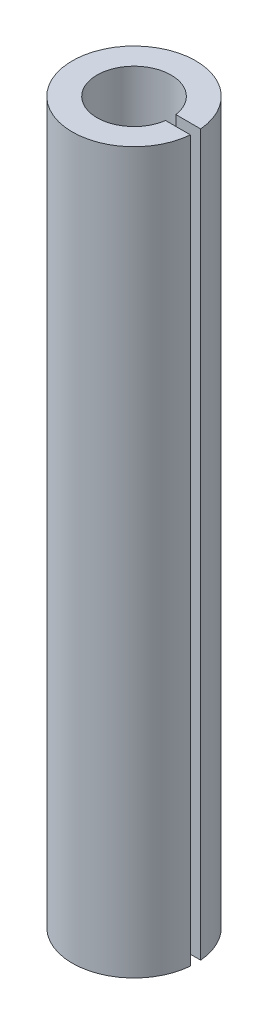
ISO-10303-21;
HEADER;
FILE_DESCRIPTION(('STEP AP214'),'2;1');
FILE_NAME('part.step','',(''),(''),'','','');
FILE_SCHEMA(('AUTOMOTIVE_DESIGN { 1 0 10303 214 1 1 1 1 }'));
ENDSEC;
DATA;
#1=APPLICATION_CONTEXT('core data for automotive mechanical design processes');
#2=APPLICATION_PROTOCOL_DEFINITION('international standard','automotive_design',2000,#1);
#3=PRODUCT_CONTEXT('',#1,'mechanical');
#4=PRODUCT('Part','Part','',(#3));
#5=PRODUCT_RELATED_PRODUCT_CATEGORY('part','',(#4));
#6=PRODUCT_DEFINITION_FORMATION('','',#4);
#7=PRODUCT_DEFINITION_CONTEXT('part definition',#1,'design');
#8=PRODUCT_DEFINITION('design','',#6,#7);
#9=PRODUCT_DEFINITION_SHAPE('','',#8);
#10=(LENGTH_UNIT() NAMED_UNIT(*) SI_UNIT(.MILLI.,.METRE.));
#11=(NAMED_UNIT(*) PLANE_ANGLE_UNIT() SI_UNIT($,.RADIAN.));
#12=(NAMED_UNIT(*) SI_UNIT($,.STERADIAN.) SOLID_ANGLE_UNIT());
#13=UNCERTAINTY_MEASURE_WITH_UNIT(LENGTH_MEASURE(1.E-05),#10,'distance_accuracy_value','');
#14=(GEOMETRIC_REPRESENTATION_CONTEXT(3) GLOBAL_UNCERTAINTY_ASSIGNED_CONTEXT((#13)) GLOBAL_UNIT_ASSIGNED_CONTEXT((#10,
#11,#12)) REPRESENTATION_CONTEXT('',''));
#15=CARTESIAN_POINT('',(0.,0.,0.));
#16=DIRECTION('',(0.,0.,1.));
#17=DIRECTION('',(1.,0.,0.));
#18=AXIS2_PLACEMENT_3D('',#15,#16,#17);
#19=CARTESIAN_POINT('',(0.,17.5,0.));
#20=DIRECTION('',(0.,-1.,0.));
#21=DIRECTION('',(0.,0.,-1.));
#22=AXIS2_PLACEMENT_3D('',#19,#20,#21);
#23=CYLINDRICAL_SURFACE('',#22,3.);
#24=CARTESIAN_POINT('',(0.,-17.5,0.));
#25=DIRECTION('',(0.,1.,0.));
#26=DIRECTION('',(0.,0.,1.));
#27=AXIS2_PLACEMENT_3D('',#24,#25,#26);
#28=CIRCLE('',#27,3.);
#29=CARTESIAN_POINT('',(2.98956518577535,-17.5,-0.25));
#30=VERTEX_POINT('',#29);
#31=CARTESIAN_POINT('',(2.98956518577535,-17.5,0.25));
#32=VERTEX_POINT('',#31);
#33=EDGE_CURVE('E74',#30,#32,#28,.T.);
#34=ORIENTED_EDGE('',*,*,#33,.T.);
#35=DIRECTION('',(0.,-1.,0.));
#36=VECTOR('',#35,1.);
#37=CARTESIAN_POINT('',(2.98956518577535,17.5,0.25));
#38=LINE('',#37,#36);
#39=CARTESIAN_POINT('',(2.98956518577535,17.5,0.25));
#40=VERTEX_POINT('',#39);
#41=EDGE_CURVE('E11',#40,#32,#38,.T.);
#42=ORIENTED_EDGE('',*,*,#41,.F.);
#43=CARTESIAN_POINT('',(0.,17.5,0.));
#44=DIRECTION('',(0.,1.,0.));
#45=DIRECTION('',(0.,0.,1.));
#46=AXIS2_PLACEMENT_3D('',#43,#44,#45);
#47=CIRCLE('',#46,3.);
#48=CARTESIAN_POINT('',(2.98956518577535,17.5,-0.25));
#49=VERTEX_POINT('',#48);
#50=EDGE_CURVE('E92',#49,#40,#47,.T.);
#51=ORIENTED_EDGE('',*,*,#50,.F.);
#52=DIRECTION('',(0.,-1.,0.));
#53=VECTOR('',#52,1.);
#54=CARTESIAN_POINT('',(2.98956518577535,17.5,-0.25));
#55=LINE('',#54,#53);
#56=EDGE_CURVE('E86',#49,#30,#55,.T.);
#57=ORIENTED_EDGE('',*,*,#56,.T.);
#58=EDGE_LOOP('',(#34,#42,#51,#57));
#59=FACE_BOUND('',#58,.T.);
#60=ADVANCED_FACE('F30',(#59),#23,.T.);
#61=CARTESIAN_POINT('',(1.78255434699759,17.5,0.25));
#62=DIRECTION('',(0.,0.,1.));
#63=DIRECTION('',(1.,0.,0.));
#64=AXIS2_PLACEMENT_3D('',#61,#62,#63);
#65=PLANE('',#64);
#66=DIRECTION('',(-1.,0.,0.));
#67=VECTOR('',#66,1.);
#68=CARTESIAN_POINT('',(1.78255434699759,-17.5,0.25));
#69=LINE('',#68,#67);
#70=CARTESIAN_POINT('',(1.78255434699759,-17.5,0.25));
#71=VERTEX_POINT('',#70);
#72=EDGE_CURVE('E70',#32,#71,#69,.T.);
#73=ORIENTED_EDGE('',*,*,#72,.T.);
#74=DIRECTION('',(0.,-1.,0.));
#75=VECTOR('',#74,1.);
#76=CARTESIAN_POINT('',(1.78255434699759,17.5,0.25));
#77=LINE('',#76,#75);
#78=CARTESIAN_POINT('',(1.78255434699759,17.5,0.25));
#79=VERTEX_POINT('',#78);
#80=EDGE_CURVE('E37',#79,#71,#77,.T.);
#81=ORIENTED_EDGE('',*,*,#80,.F.);
#82=DIRECTION('',(-1.,0.,0.));
#83=VECTOR('',#82,1.);
#84=CARTESIAN_POINT('',(1.78255434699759,17.5,0.25));
#85=LINE('',#84,#83);
#86=EDGE_CURVE('E82',#40,#79,#85,.T.);
#87=ORIENTED_EDGE('',*,*,#86,.F.);
#88=ORIENTED_EDGE('',*,*,#41,.T.);
#89=EDGE_LOOP('',(#73,#81,#87,#88));
#90=FACE_BOUND('',#89,.T.);
#91=ADVANCED_FACE('F81',(#90),#65,.F.);
#92=CARTESIAN_POINT('',(0.,17.5,0.));
#93=DIRECTION('',(0.,-1.,0.));
#94=DIRECTION('',(0.,0.,-1.));
#95=AXIS2_PLACEMENT_3D('',#92,#93,#94);
#96=CYLINDRICAL_SURFACE('',#95,1.8);
#97=CARTESIAN_POINT('',(0.,-17.5,0.));
#98=DIRECTION('',(0.,-1.,0.));
#99=DIRECTION('',(0.,0.,1.));
#100=AXIS2_PLACEMENT_3D('',#97,#98,#99);
#101=CIRCLE('',#100,1.8);
#102=CARTESIAN_POINT('',(1.78255434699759,-17.5,-0.25));
#103=VERTEX_POINT('',#102);
#104=EDGE_CURVE('E75',#71,#103,#101,.T.);
#105=ORIENTED_EDGE('',*,*,#104,.T.);
#106=DIRECTION('',(0.,-1.,0.));
#107=VECTOR('',#106,1.);
#108=CARTESIAN_POINT('',(1.78255434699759,17.5,-0.25));
#109=LINE('',#108,#107);
#110=CARTESIAN_POINT('',(1.78255434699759,17.5,-0.25));
#111=VERTEX_POINT('',#110);
#112=EDGE_CURVE('E98',#111,#103,#109,.T.);
#113=ORIENTED_EDGE('',*,*,#112,.F.);
#114=CARTESIAN_POINT('',(0.,17.5,0.));
#115=DIRECTION('',(0.,-1.,0.));
#116=DIRECTION('',(0.,0.,1.));
#117=AXIS2_PLACEMENT_3D('',#114,#115,#116);
#118=CIRCLE('',#117,1.8);
#119=EDGE_CURVE('E49',#79,#111,#118,.T.);
#120=ORIENTED_EDGE('',*,*,#119,.F.);
#121=ORIENTED_EDGE('',*,*,#80,.T.);
#122=EDGE_LOOP('',(#105,#113,#120,#121));
#123=FACE_BOUND('',#122,.T.);
#124=ADVANCED_FACE('F101',(#123),#96,.F.);
#125=CARTESIAN_POINT('',(1.78255434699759,17.5,-0.25));
#126=DIRECTION('',(0.,0.,-1.));
#127=DIRECTION('',(-1.,0.,0.));
#128=AXIS2_PLACEMENT_3D('',#125,#126,#127);
#129=PLANE('',#128);
#130=DIRECTION('',(1.,0.,0.));
#131=VECTOR('',#130,1.);
#132=CARTESIAN_POINT('',(1.78255434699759,-17.5,-0.25));
#133=LINE('',#132,#131);
#134=EDGE_CURVE('E90',#103,#30,#133,.T.);
#135=ORIENTED_EDGE('',*,*,#134,.T.);
#136=ORIENTED_EDGE('',*,*,#56,.F.);
#137=DIRECTION('',(1.,0.,0.));
#138=VECTOR('',#137,1.);
#139=CARTESIAN_POINT('',(1.78255434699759,17.5,-0.25));
#140=LINE('',#139,#138);
#141=EDGE_CURVE('E44',#111,#49,#140,.T.);
#142=ORIENTED_EDGE('',*,*,#141,.F.);
#143=ORIENTED_EDGE('',*,*,#112,.T.);
#144=EDGE_LOOP('',(#135,#136,#142,#143));
#145=FACE_BOUND('',#144,.T.);
#146=ADVANCED_FACE('F103',(#145),#129,.F.);
#147=CARTESIAN_POINT('',(0.,17.5,0.));
#148=DIRECTION('',(0.,1.,0.));
#149=DIRECTION('',(0.,0.,1.));
#150=AXIS2_PLACEMENT_3D('',#147,#148,#149);
#151=PLANE('',#150);
#152=ORIENTED_EDGE('',*,*,#50,.T.);
#153=ORIENTED_EDGE('',*,*,#86,.T.);
#154=ORIENTED_EDGE('',*,*,#119,.T.);
#155=ORIENTED_EDGE('',*,*,#141,.T.);
#156=EDGE_LOOP('',(#152,#153,#154,#155));
#157=FACE_BOUND('',#156,.T.);
#158=ADVANCED_FACE('F104',(#157),#151,.T.);
#159=CARTESIAN_POINT('',(0.,-17.5,0.));
#160=DIRECTION('',(0.,1.,0.));
#161=DIRECTION('',(0.,0.,1.));
#162=AXIS2_PLACEMENT_3D('',#159,#160,#161);
#163=PLANE('',#162);
#164=ORIENTED_EDGE('',*,*,#33,.F.);
#165=ORIENTED_EDGE('',*,*,#134,.F.);
#166=ORIENTED_EDGE('',*,*,#104,.F.);
#167=ORIENTED_EDGE('',*,*,#72,.F.);
#168=EDGE_LOOP('',(#164,#165,#166,#167));
#169=FACE_BOUND('',#168,.T.);
#170=ADVANCED_FACE('F71',(#169),#163,.F.);
#171=CLOSED_SHELL('',(#60,#91,#124,#146,#158,#170));
#172=MANIFOLD_SOLID_BREP('B2',#171);
#173=ADVANCED_BREP_SHAPE_REPRESENTATION('',(#18,#172),#14);
#174=SHAPE_DEFINITION_REPRESENTATION(#9,#173);
ENDSEC;
END-ISO-10303-21;
